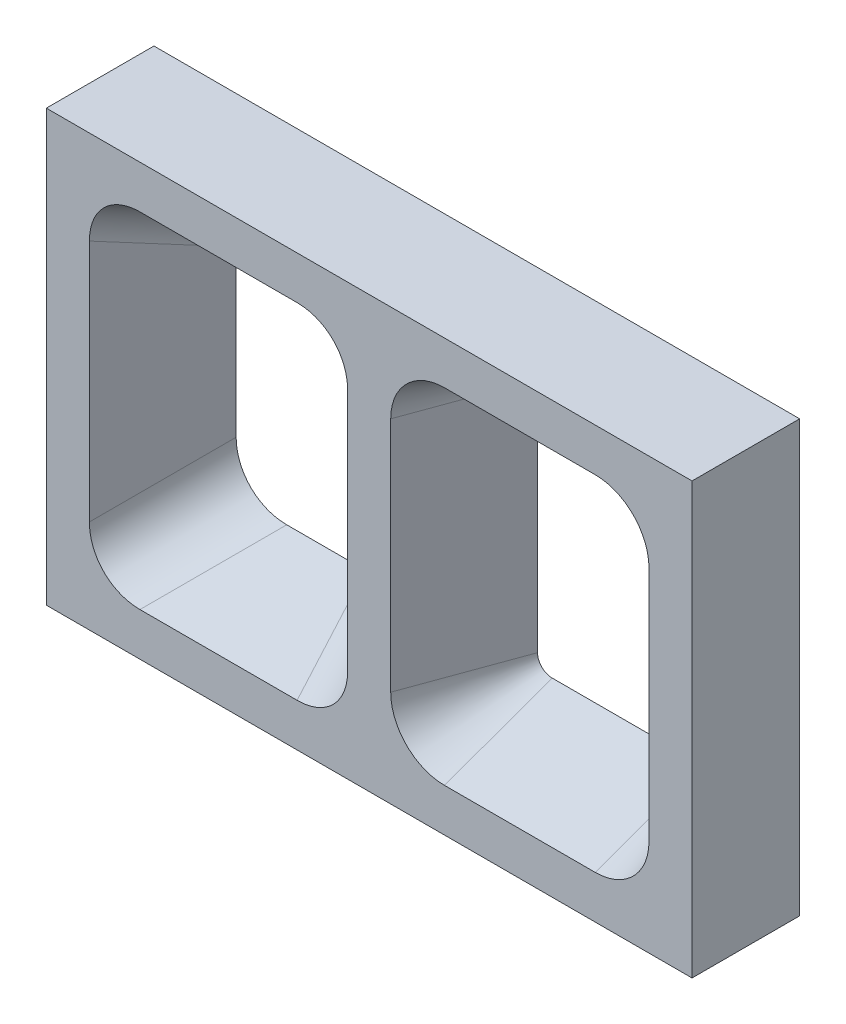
ISO-10303-21;
HEADER;
FILE_DESCRIPTION(('STEP AP214'),'2;1');
FILE_NAME('part.step','',(''),(''),'','','');
FILE_SCHEMA(('AUTOMOTIVE_DESIGN { 1 0 10303 214 1 1 1 1 }'));
ENDSEC;
DATA;
#1=APPLICATION_CONTEXT('core data for automotive mechanical design processes');
#2=APPLICATION_PROTOCOL_DEFINITION('international standard','automotive_design',2000,#1);
#3=PRODUCT_CONTEXT('',#1,'mechanical');
#4=PRODUCT('Part','Part','',(#3));
#5=PRODUCT_RELATED_PRODUCT_CATEGORY('part','',(#4));
#6=PRODUCT_DEFINITION_FORMATION('','',#4);
#7=PRODUCT_DEFINITION_CONTEXT('part definition',#1,'design');
#8=PRODUCT_DEFINITION('design','',#6,#7);
#9=PRODUCT_DEFINITION_SHAPE('','',#8);
#10=(LENGTH_UNIT() NAMED_UNIT(*) SI_UNIT(.MILLI.,.METRE.));
#11=(NAMED_UNIT(*) PLANE_ANGLE_UNIT() SI_UNIT($,.RADIAN.));
#12=(NAMED_UNIT(*) SI_UNIT($,.STERADIAN.) SOLID_ANGLE_UNIT());
#13=UNCERTAINTY_MEASURE_WITH_UNIT(LENGTH_MEASURE(1.E-05),#10,'distance_accuracy_value','');
#14=(GEOMETRIC_REPRESENTATION_CONTEXT(3) GLOBAL_UNCERTAINTY_ASSIGNED_CONTEXT((#13)) GLOBAL_UNIT_ASSIGNED_CONTEXT((#10,
#11,#12)) REPRESENTATION_CONTEXT('',''));
#15=CARTESIAN_POINT('',(0.,0.,0.));
#16=DIRECTION('',(0.,0.,1.));
#17=DIRECTION('',(1.,0.,0.));
#18=AXIS2_PLACEMENT_3D('',#15,#16,#17);
#19=CARTESIAN_POINT('',(0.,0.,12.7));
#20=DIRECTION('',(1.,0.,0.));
#21=DIRECTION('',(0.,0.,-1.));
#22=AXIS2_PLACEMENT_3D('',#19,#20,#21);
#23=PLANE('',#22);
#24=DIRECTION('',(0.,-1.,0.));
#25=VECTOR('',#24,1.);
#26=CARTESIAN_POINT('',(0.,0.,0.));
#27=LINE('',#26,#25);
#28=CARTESIAN_POINT('',(0.,50.8,0.));
#29=VERTEX_POINT('',#28);
#30=CARTESIAN_POINT('',(0.,0.,0.));
#31=VERTEX_POINT('',#30);
#32=EDGE_CURVE('E264',#29,#31,#27,.T.);
#33=ORIENTED_EDGE('',*,*,#32,.T.);
#34=DIRECTION('',(0.,0.,-1.));
#35=VECTOR('',#34,1.);
#36=CARTESIAN_POINT('',(0.,0.,12.7));
#37=LINE('',#36,#35);
#38=CARTESIAN_POINT('',(0.,0.,12.7));
#39=VERTEX_POINT('',#38);
#40=EDGE_CURVE('E296',#39,#31,#37,.T.);
#41=ORIENTED_EDGE('',*,*,#40,.F.);
#42=DIRECTION('',(0.,-1.,0.));
#43=VECTOR('',#42,1.);
#44=CARTESIAN_POINT('',(0.,0.,12.7));
#45=LINE('',#44,#43);
#46=CARTESIAN_POINT('',(0.,50.8,12.7));
#47=VERTEX_POINT('',#46);
#48=EDGE_CURVE('E278',#47,#39,#45,.T.);
#49=ORIENTED_EDGE('',*,*,#48,.F.);
#50=DIRECTION('',(0.,0.,-1.));
#51=VECTOR('',#50,1.);
#52=CARTESIAN_POINT('',(0.,50.8,12.7));
#53=LINE('',#52,#51);
#54=EDGE_CURVE('E287',#47,#29,#53,.T.);
#55=ORIENTED_EDGE('',*,*,#54,.T.);
#56=EDGE_LOOP('',(#33,#41,#49,#55));
#57=FACE_BOUND('',#56,.T.);
#58=ADVANCED_FACE('F35',(#57),#23,.F.);
#59=CARTESIAN_POINT('',(0.,0.,12.7));
#60=DIRECTION('',(0.,1.,0.));
#61=DIRECTION('',(0.,0.,1.));
#62=AXIS2_PLACEMENT_3D('',#59,#60,#61);
#63=PLANE('',#62);
#64=DIRECTION('',(1.,0.,0.));
#65=VECTOR('',#64,1.);
#66=CARTESIAN_POINT('',(0.,0.,0.));
#67=LINE('',#66,#65);
#68=CARTESIAN_POINT('',(76.2,0.,0.));
#69=VERTEX_POINT('',#68);
#70=EDGE_CURVE('E272',#31,#69,#67,.T.);
#71=ORIENTED_EDGE('',*,*,#70,.T.);
#72=DIRECTION('',(0.,0.,-1.));
#73=VECTOR('',#72,1.);
#74=CARTESIAN_POINT('',(76.2,0.,12.7));
#75=LINE('',#74,#73);
#76=CARTESIAN_POINT('',(76.2,0.,12.7));
#77=VERTEX_POINT('',#76);
#78=EDGE_CURVE('E293',#77,#69,#75,.T.);
#79=ORIENTED_EDGE('',*,*,#78,.F.);
#80=DIRECTION('',(1.,0.,0.));
#81=VECTOR('',#80,1.);
#82=CARTESIAN_POINT('',(0.,0.,12.7));
#83=LINE('',#82,#81);
#84=EDGE_CURVE('E281',#39,#77,#83,.T.);
#85=ORIENTED_EDGE('',*,*,#84,.F.);
#86=ORIENTED_EDGE('',*,*,#40,.T.);
#87=EDGE_LOOP('',(#71,#79,#85,#86));
#88=FACE_BOUND('',#87,.T.);
#89=ADVANCED_FACE('F372',(#88),#63,.F.);
#90=CARTESIAN_POINT('',(76.2,0.,12.7));
#91=DIRECTION('',(-1.,0.,0.));
#92=DIRECTION('',(0.,0.,1.));
#93=AXIS2_PLACEMENT_3D('',#90,#91,#92);
#94=PLANE('',#93);
#95=DIRECTION('',(0.,1.,0.));
#96=VECTOR('',#95,1.);
#97=CARTESIAN_POINT('',(76.2,0.,0.));
#98=LINE('',#97,#96);
#99=CARTESIAN_POINT('',(76.2,50.8,0.));
#100=VERTEX_POINT('',#99);
#101=EDGE_CURVE('E274',#69,#100,#98,.T.);
#102=ORIENTED_EDGE('',*,*,#101,.T.);
#103=DIRECTION('',(0.,0.,-1.));
#104=VECTOR('',#103,1.);
#105=CARTESIAN_POINT('',(76.2,50.8,12.7));
#106=LINE('',#105,#104);
#107=CARTESIAN_POINT('',(76.2,50.8,12.7));
#108=VERTEX_POINT('',#107);
#109=EDGE_CURVE('E290',#108,#100,#106,.T.);
#110=ORIENTED_EDGE('',*,*,#109,.F.);
#111=DIRECTION('',(0.,1.,0.));
#112=VECTOR('',#111,1.);
#113=CARTESIAN_POINT('',(76.2,0.,12.7));
#114=LINE('',#113,#112);
#115=EDGE_CURVE('E283',#77,#108,#114,.T.);
#116=ORIENTED_EDGE('',*,*,#115,.F.);
#117=ORIENTED_EDGE('',*,*,#78,.T.);
#118=EDGE_LOOP('',(#102,#110,#116,#117));
#119=FACE_BOUND('',#118,.T.);
#120=ADVANCED_FACE('F377',(#119),#94,.F.);
#121=CARTESIAN_POINT('',(0.,50.8,12.7));
#122=DIRECTION('',(0.,-1.,0.));
#123=DIRECTION('',(0.,0.,-1.));
#124=AXIS2_PLACEMENT_3D('',#121,#122,#123);
#125=PLANE('',#124);
#126=DIRECTION('',(-1.,0.,0.));
#127=VECTOR('',#126,1.);
#128=CARTESIAN_POINT('',(0.,50.8,0.));
#129=LINE('',#128,#127);
#130=EDGE_CURVE('E276',#100,#29,#129,.T.);
#131=ORIENTED_EDGE('',*,*,#130,.T.);
#132=ORIENTED_EDGE('',*,*,#54,.F.);
#133=DIRECTION('',(-1.,0.,0.));
#134=VECTOR('',#133,1.);
#135=CARTESIAN_POINT('',(0.,50.8,12.7));
#136=LINE('',#135,#134);
#137=EDGE_CURVE('E285',#108,#47,#136,.T.);
#138=ORIENTED_EDGE('',*,*,#137,.F.);
#139=ORIENTED_EDGE('',*,*,#109,.T.);
#140=EDGE_LOOP('',(#131,#132,#138,#139));
#141=FACE_BOUND('',#140,.T.);
#142=ADVANCED_FACE('F390',(#141),#125,.F.);
#143=CARTESIAN_POINT('',(0.,50.8,12.7));
#144=DIRECTION('',(0.,0.,-1.));
#145=DIRECTION('',(-1.,0.,0.));
#146=AXIS2_PLACEMENT_3D('',#143,#144,#145);
#147=PLANE('',#146);
#148=DIRECTION('',(0.,-1.,0.));
#149=VECTOR('',#148,1.);
#150=CARTESIAN_POINT('',(40.64,39.37,12.7));
#151=LINE('',#150,#149);
#152=CARTESIAN_POINT('',(40.64,39.37,12.7));
#153=VERTEX_POINT('',#152);
#154=CARTESIAN_POINT('',(40.64,11.43,12.7));
#155=VERTEX_POINT('',#154);
#156=EDGE_CURVE('E188',#153,#155,#151,.T.);
#157=ORIENTED_EDGE('',*,*,#156,.F.);
#158=CARTESIAN_POINT('',(46.99,39.37,12.7));
#159=DIRECTION('',(0.,0.,1.));
#160=DIRECTION('',(-1.,0.,0.));
#161=AXIS2_PLACEMENT_3D('',#158,#159,#160);
#162=CIRCLE('',#161,6.35);
#163=CARTESIAN_POINT('',(46.9900000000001,45.72,12.7));
#164=VERTEX_POINT('',#163);
#165=EDGE_CURVE('E192',#164,#153,#162,.T.);
#166=ORIENTED_EDGE('',*,*,#165,.F.);
#167=DIRECTION('',(-1.,0.,0.));
#168=VECTOR('',#167,1.);
#169=CARTESIAN_POINT('',(64.77,45.72,12.7));
#170=LINE('',#169,#168);
#171=CARTESIAN_POINT('',(64.77,45.72,12.7));
#172=VERTEX_POINT('',#171);
#173=EDGE_CURVE('E212',#172,#164,#170,.T.);
#174=ORIENTED_EDGE('',*,*,#173,.F.);
#175=CARTESIAN_POINT('',(64.77,39.37,12.7));
#176=DIRECTION('',(0.,0.,1.));
#177=DIRECTION('',(1.,0.,0.));
#178=AXIS2_PLACEMENT_3D('',#175,#176,#177);
#179=CIRCLE('',#178,6.35);
#180=CARTESIAN_POINT('',(71.12,39.37,12.7));
#181=VERTEX_POINT('',#180);
#182=EDGE_CURVE('E209',#181,#172,#179,.T.);
#183=ORIENTED_EDGE('',*,*,#182,.F.);
#184=DIRECTION('',(0.,1.,0.));
#185=VECTOR('',#184,1.);
#186=CARTESIAN_POINT('',(71.12,11.43,12.7));
#187=LINE('',#186,#185);
#188=CARTESIAN_POINT('',(71.12,11.43,12.7));
#189=VERTEX_POINT('',#188);
#190=EDGE_CURVE('E206',#189,#181,#187,.T.);
#191=ORIENTED_EDGE('',*,*,#190,.F.);
#192=CARTESIAN_POINT('',(64.77,11.43,12.7));
#193=DIRECTION('',(0.,0.,1.));
#194=DIRECTION('',(1.,0.,0.));
#195=AXIS2_PLACEMENT_3D('',#192,#193,#194);
#196=CIRCLE('',#195,6.35);
#197=CARTESIAN_POINT('',(64.77,5.08,12.7));
#198=VERTEX_POINT('',#197);
#199=EDGE_CURVE('E200',#198,#189,#196,.T.);
#200=ORIENTED_EDGE('',*,*,#199,.F.);
#201=DIRECTION('',(1.,0.,0.));
#202=VECTOR('',#201,1.);
#203=CARTESIAN_POINT('',(46.9900000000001,5.08,12.7));
#204=LINE('',#203,#202);
#205=CARTESIAN_POINT('',(46.9900000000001,5.08,12.7));
#206=VERTEX_POINT('',#205);
#207=EDGE_CURVE('E198',#206,#198,#204,.T.);
#208=ORIENTED_EDGE('',*,*,#207,.F.);
#209=CARTESIAN_POINT('',(46.99,11.43,12.7));
#210=DIRECTION('',(0.,0.,1.));
#211=DIRECTION('',(1.,0.,0.));
#212=AXIS2_PLACEMENT_3D('',#209,#210,#211);
#213=CIRCLE('',#212,6.35);
#214=EDGE_CURVE('E176',#155,#206,#213,.T.);
#215=ORIENTED_EDGE('',*,*,#214,.F.);
#216=EDGE_LOOP('',(#157,#166,#174,#183,#191,#200,#208,#215));
#217=FACE_BOUND('',#216,.T.);
#218=DIRECTION('',(0.,-1.,0.));
#219=VECTOR('',#218,1.);
#220=CARTESIAN_POINT('',(5.08,45.72,12.7));
#221=LINE('',#220,#219);
#222=CARTESIAN_POINT('',(5.08,39.7529518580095,12.7));
#223=VERTEX_POINT('',#222);
#224=CARTESIAN_POINT('',(5.08,11.0470481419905,12.7));
#225=VERTEX_POINT('',#224);
#226=EDGE_CURVE('E250',#223,#225,#221,.T.);
#227=ORIENTED_EDGE('',*,*,#226,.F.);
#228=CARTESIAN_POINT('',(11.837528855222,38.962471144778,12.7));
#229=DIRECTION('',(0.,0.,-1.));
#230=DIRECTION('',(0.707106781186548,-0.707106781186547,0.));
#231=AXIS2_PLACEMENT_3D('',#228,#229,#230);
#232=ELLIPSE('',#231,7.14184097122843,6.35);
#233=CARTESIAN_POINT('',(11.0470481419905,45.72,12.7));
#234=VERTEX_POINT('',#233);
#235=EDGE_CURVE('E42',#223,#234,#232,.T.);
#236=ORIENTED_EDGE('',*,*,#235,.T.);
#237=DIRECTION('',(-1.,0.,0.));
#238=VECTOR('',#237,1.);
#239=CARTESIAN_POINT('',(35.56,45.72,12.7));
#240=LINE('',#239,#238);
#241=CARTESIAN_POINT('',(29.5929518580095,45.72,12.7));
#242=VERTEX_POINT('',#241);
#243=EDGE_CURVE('E218',#242,#234,#240,.T.);
#244=ORIENTED_EDGE('',*,*,#243,.F.);
#245=CARTESIAN_POINT('',(28.802471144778,38.962471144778,12.7));
#246=DIRECTION('',(0.,0.,-1.));
#247=DIRECTION('',(-0.707106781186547,-0.707106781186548,0.));
#248=AXIS2_PLACEMENT_3D('',#245,#246,#247);
#249=ELLIPSE('',#248,7.14184097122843,6.35);
#250=CARTESIAN_POINT('',(35.56,39.7529518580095,12.7));
#251=VERTEX_POINT('',#250);
#252=EDGE_CURVE('E326',#242,#251,#249,.T.);
#253=ORIENTED_EDGE('',*,*,#252,.T.);
#254=DIRECTION('',(0.,1.,0.));
#255=VECTOR('',#254,1.);
#256=CARTESIAN_POINT('',(35.56,45.72,12.7));
#257=LINE('',#256,#255);
#258=CARTESIAN_POINT('',(35.56,11.0470481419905,12.7));
#259=VERTEX_POINT('',#258);
#260=EDGE_CURVE('E256',#259,#251,#257,.T.);
#261=ORIENTED_EDGE('',*,*,#260,.F.);
#262=CARTESIAN_POINT('',(28.802471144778,11.837528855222,12.7));
#263=DIRECTION('',(0.,0.,-1.));
#264=DIRECTION('',(-0.707106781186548,0.707106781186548,0.));
#265=AXIS2_PLACEMENT_3D('',#262,#263,#264);
#266=ELLIPSE('',#265,7.14184097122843,6.35);
#267=CARTESIAN_POINT('',(29.5929518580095,5.08,12.7));
#268=VERTEX_POINT('',#267);
#269=EDGE_CURVE('E322',#259,#268,#266,.T.);
#270=ORIENTED_EDGE('',*,*,#269,.T.);
#271=DIRECTION('',(1.,0.,0.));
#272=VECTOR('',#271,1.);
#273=CARTESIAN_POINT('',(5.08,5.08,12.7));
#274=LINE('',#273,#272);
#275=CARTESIAN_POINT('',(11.0470481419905,5.08,12.7));
#276=VERTEX_POINT('',#275);
#277=EDGE_CURVE('E253',#276,#268,#274,.T.);
#278=ORIENTED_EDGE('',*,*,#277,.F.);
#279=CARTESIAN_POINT('',(11.837528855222,11.837528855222,12.7));
#280=DIRECTION('',(0.,0.,-1.));
#281=DIRECTION('',(0.707106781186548,0.707106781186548,0.));
#282=AXIS2_PLACEMENT_3D('',#279,#280,#281);
#283=ELLIPSE('',#282,7.14184097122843,6.35);
#284=EDGE_CURVE('E318',#276,#225,#283,.T.);
#285=ORIENTED_EDGE('',*,*,#284,.T.);
#286=EDGE_LOOP('',(#227,#236,#244,#253,#261,#270,#278,#285));
#287=FACE_BOUND('',#286,.T.);
#288=ORIENTED_EDGE('',*,*,#48,.T.);
#289=ORIENTED_EDGE('',*,*,#84,.T.);
#290=ORIENTED_EDGE('',*,*,#115,.T.);
#291=ORIENTED_EDGE('',*,*,#137,.T.);
#292=EDGE_LOOP('',(#288,#289,#290,#291));
#293=FACE_BOUND('',#292,.T.);
#294=ADVANCED_FACE('F194',(#217,#287,#293),#147,.F.);
#295=CARTESIAN_POINT('',(0.,50.8,0.));
#296=DIRECTION('',(0.,0.,-1.));
#297=DIRECTION('',(-1.,0.,0.));
#298=AXIS2_PLACEMENT_3D('',#295,#296,#297);
#299=PLANE('',#298);
#300=CARTESIAN_POINT('',(46.99,39.37,0.));
#301=DIRECTION('',(0.,0.,-1.));
#302=DIRECTION('',(-1.,0.,0.));
#303=AXIS2_PLACEMENT_3D('',#300,#301,#302);
#304=CIRCLE('',#303,1.72757802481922);
#305=CARTESIAN_POINT('',(46.9900000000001,41.0975780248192,0.));
#306=VERTEX_POINT('',#305);
#307=CARTESIAN_POINT('',(45.2624219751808,39.37,0.));
#308=VERTEX_POINT('',#307);
#309=EDGE_CURVE('E215',#306,#308,#304,.F.);
#310=ORIENTED_EDGE('',*,*,#309,.T.);
#311=DIRECTION('',(0.,-1.,0.));
#312=VECTOR('',#311,1.);
#313=CARTESIAN_POINT('',(45.2624219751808,39.37,0.));
#314=LINE('',#313,#312);
#315=CARTESIAN_POINT('',(45.2624219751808,11.43,0.));
#316=VERTEX_POINT('',#315);
#317=EDGE_CURVE('E232',#308,#316,#314,.T.);
#318=ORIENTED_EDGE('',*,*,#317,.T.);
#319=CARTESIAN_POINT('',(46.99,11.43,0.));
#320=DIRECTION('',(0.,0.,-1.));
#321=DIRECTION('',(-1.,0.,0.));
#322=AXIS2_PLACEMENT_3D('',#319,#320,#321);
#323=CIRCLE('',#322,1.72757802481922);
#324=CARTESIAN_POINT('',(46.99,9.70242197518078,0.));
#325=VERTEX_POINT('',#324);
#326=EDGE_CURVE('E179',#316,#325,#323,.F.);
#327=ORIENTED_EDGE('',*,*,#326,.T.);
#328=DIRECTION('',(1.,0.,0.));
#329=VECTOR('',#328,1.);
#330=CARTESIAN_POINT('',(46.9900000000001,9.70242197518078,0.));
#331=LINE('',#330,#329);
#332=CARTESIAN_POINT('',(64.77,9.70242197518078,0.));
#333=VERTEX_POINT('',#332);
#334=EDGE_CURVE('E244',#325,#333,#331,.T.);
#335=ORIENTED_EDGE('',*,*,#334,.T.);
#336=CARTESIAN_POINT('',(64.77,11.43,0.));
#337=DIRECTION('',(0.,0.,-1.));
#338=DIRECTION('',(-1.,0.,0.));
#339=AXIS2_PLACEMENT_3D('',#336,#337,#338);
#340=CIRCLE('',#339,1.72757802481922);
#341=CARTESIAN_POINT('',(66.4975780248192,11.43,0.));
#342=VERTEX_POINT('',#341);
#343=EDGE_CURVE('E241',#333,#342,#340,.F.);
#344=ORIENTED_EDGE('',*,*,#343,.T.);
#345=DIRECTION('',(0.,1.,0.));
#346=VECTOR('',#345,1.);
#347=CARTESIAN_POINT('',(66.4975780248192,11.43,0.));
#348=LINE('',#347,#346);
#349=CARTESIAN_POINT('',(66.4975780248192,39.37,0.));
#350=VERTEX_POINT('',#349);
#351=EDGE_CURVE('E238',#342,#350,#348,.T.);
#352=ORIENTED_EDGE('',*,*,#351,.T.);
#353=CARTESIAN_POINT('',(64.77,39.37,0.));
#354=DIRECTION('',(0.,0.,-1.));
#355=DIRECTION('',(-1.,0.,0.));
#356=AXIS2_PLACEMENT_3D('',#353,#354,#355);
#357=CIRCLE('',#356,1.72757802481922);
#358=CARTESIAN_POINT('',(64.77,41.0975780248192,0.));
#359=VERTEX_POINT('',#358);
#360=EDGE_CURVE('E235',#350,#359,#357,.F.);
#361=ORIENTED_EDGE('',*,*,#360,.T.);
#362=DIRECTION('',(-1.,0.,0.));
#363=VECTOR('',#362,1.);
#364=CARTESIAN_POINT('',(64.77,41.0975780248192,0.));
#365=LINE('',#364,#363);
#366=EDGE_CURVE('E220',#359,#306,#365,.T.);
#367=ORIENTED_EDGE('',*,*,#366,.T.);
#368=EDGE_LOOP('',(#310,#318,#327,#335,#344,#352,#361,#367));
#369=FACE_BOUND('',#368,.T.);
#370=DIRECTION('',(0.,1.,0.));
#371=VECTOR('',#370,1.);
#372=CARTESIAN_POINT('',(30.9375780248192,45.72,0.));
#373=LINE('',#372,#371);
#374=CARTESIAN_POINT('',(30.9375780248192,15.6694701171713,0.));
#375=VERTEX_POINT('',#374);
#376=CARTESIAN_POINT('',(30.9375780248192,35.1305298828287,0.));
#377=VERTEX_POINT('',#376);
#378=EDGE_CURVE('E262',#375,#377,#373,.T.);
#379=ORIENTED_EDGE('',*,*,#378,.T.);
#380=CARTESIAN_POINT('',(24.1800491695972,34.3400491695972,0.));
#381=DIRECTION('',(0.,0.,-1.));
#382=DIRECTION('',(-0.707106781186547,-0.707106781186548,0.));
#383=AXIS2_PLACEMENT_3D('',#380,#381,#382);
#384=ELLIPSE('',#383,7.14184097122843,6.35);
#385=CARTESIAN_POINT('',(24.9705298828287,41.0975780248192,0.));
#386=VERTEX_POINT('',#385);
#387=EDGE_CURVE('E56',#377,#386,#384,.F.);
#388=ORIENTED_EDGE('',*,*,#387,.T.);
#389=DIRECTION('',(-1.,0.,0.));
#390=VECTOR('',#389,1.);
#391=CARTESIAN_POINT('',(5.08,41.0975780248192,0.));
#392=LINE('',#391,#390);
#393=CARTESIAN_POINT('',(15.6694701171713,41.0975780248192,0.));
#394=VERTEX_POINT('',#393);
#395=EDGE_CURVE('E259',#386,#394,#392,.T.);
#396=ORIENTED_EDGE('',*,*,#395,.T.);
#397=CARTESIAN_POINT('',(16.4599508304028,34.3400491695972,0.));
#398=DIRECTION('',(0.,0.,-1.));
#399=DIRECTION('',(0.707106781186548,-0.707106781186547,0.));
#400=AXIS2_PLACEMENT_3D('',#397,#398,#399);
#401=ELLIPSE('',#400,7.14184097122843,6.35);
#402=CARTESIAN_POINT('',(9.70242197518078,35.1305298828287,0.));
#403=VERTEX_POINT('',#402);
#404=EDGE_CURVE('E11',#394,#403,#401,.F.);
#405=ORIENTED_EDGE('',*,*,#404,.T.);
#406=DIRECTION('',(0.,-1.,0.));
#407=VECTOR('',#406,1.);
#408=CARTESIAN_POINT('',(9.70242197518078,45.72,0.));
#409=LINE('',#408,#407);
#410=CARTESIAN_POINT('',(9.70242197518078,15.6694701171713,0.));
#411=VERTEX_POINT('',#410);
#412=EDGE_CURVE('E261',#403,#411,#409,.T.);
#413=ORIENTED_EDGE('',*,*,#412,.T.);
#414=CARTESIAN_POINT('',(16.4599508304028,16.4599508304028,0.));
#415=DIRECTION('',(0.,0.,-1.));
#416=DIRECTION('',(0.707106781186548,0.707106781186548,0.));
#417=AXIS2_PLACEMENT_3D('',#414,#415,#416);
#418=ELLIPSE('',#417,7.14184097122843,6.35);
#419=CARTESIAN_POINT('',(15.6694701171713,9.70242197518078,0.));
#420=VERTEX_POINT('',#419);
#421=EDGE_CURVE('E320',#411,#420,#418,.F.);
#422=ORIENTED_EDGE('',*,*,#421,.T.);
#423=DIRECTION('',(1.,0.,0.));
#424=VECTOR('',#423,1.);
#425=CARTESIAN_POINT('',(5.08,9.70242197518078,0.));
#426=LINE('',#425,#424);
#427=CARTESIAN_POINT('',(24.9705298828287,9.70242197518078,0.));
#428=VERTEX_POINT('',#427);
#429=EDGE_CURVE('E265',#420,#428,#426,.T.);
#430=ORIENTED_EDGE('',*,*,#429,.T.);
#431=CARTESIAN_POINT('',(24.1800491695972,16.4599508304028,0.));
#432=DIRECTION('',(0.,0.,-1.));
#433=DIRECTION('',(-0.707106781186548,0.707106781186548,0.));
#434=AXIS2_PLACEMENT_3D('',#431,#432,#433);
#435=ELLIPSE('',#434,7.14184097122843,6.35);
#436=EDGE_CURVE('E324',#428,#375,#435,.F.);
#437=ORIENTED_EDGE('',*,*,#436,.T.);
#438=EDGE_LOOP('',(#379,#388,#396,#405,#413,#422,#430,#437));
#439=FACE_BOUND('',#438,.T.);
#440=ORIENTED_EDGE('',*,*,#32,.F.);
#441=ORIENTED_EDGE('',*,*,#130,.F.);
#442=ORIENTED_EDGE('',*,*,#101,.F.);
#443=ORIENTED_EDGE('',*,*,#70,.F.);
#444=EDGE_LOOP('',(#440,#441,#442,#443));
#445=FACE_BOUND('',#444,.T.);
#446=ADVANCED_FACE('F338',(#369,#439,#445),#299,.T.);
#447=CARTESIAN_POINT('',(35.56,45.72,12.7));
#448=DIRECTION('',(0.,0.939692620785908,-0.342020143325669));
#449=DIRECTION('',(0.,0.342020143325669,0.939692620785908));
#450=AXIS2_PLACEMENT_3D('',#447,#448,#449);
#451=PLANE('',#450);
#452=ORIENTED_EDGE('',*,*,#395,.F.);
#453=DIRECTION('',(0.323615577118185,0.323615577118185,0.889126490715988));
#454=VECTOR('',#453,1.);
#455=CARTESIAN_POINT('',(30.2178631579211,46.3449112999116,14.4169296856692));
#456=LINE('',#455,#454);
#457=EDGE_CURVE('E315',#386,#242,#456,.T.);
#458=ORIENTED_EDGE('',*,*,#457,.T.);
#459=ORIENTED_EDGE('',*,*,#243,.T.);
#460=DIRECTION('',(-0.323615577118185,0.323615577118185,0.889126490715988));
#461=VECTOR('',#460,1.);
#462=CARTESIAN_POINT('',(15.0445588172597,41.7224893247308,1.71692968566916));
#463=LINE('',#462,#461);
#464=EDGE_CURVE('E49',#234,#394,#463,.F.);
#465=ORIENTED_EDGE('',*,*,#464,.T.);
#466=EDGE_LOOP('',(#452,#458,#459,#465));
#467=FACE_BOUND('',#466,.T.);
#468=ADVANCED_FACE('F333',(#467),#451,.F.);
#469=CARTESIAN_POINT('',(35.56,45.72,12.7));
#470=DIRECTION('',(0.939692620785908,0.,-0.342020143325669));
#471=DIRECTION('',(-0.342020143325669,0.,-0.939692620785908));
#472=AXIS2_PLACEMENT_3D('',#469,#470,#471);
#473=PLANE('',#472);
#474=ORIENTED_EDGE('',*,*,#378,.F.);
#475=DIRECTION('',(0.323615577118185,-0.323615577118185,0.889126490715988));
#476=VECTOR('',#475,1.);
#477=CARTESIAN_POINT('',(36.1849112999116,10.4221368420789,14.4169296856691));
#478=LINE('',#477,#476);
#479=EDGE_CURVE('E311',#375,#259,#478,.T.);
#480=ORIENTED_EDGE('',*,*,#479,.T.);
#481=ORIENTED_EDGE('',*,*,#260,.T.);
#482=DIRECTION('',(0.323615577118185,0.323615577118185,0.889126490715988));
#483=VECTOR('',#482,1.);
#484=CARTESIAN_POINT('',(31.5624893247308,35.7554411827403,1.71692968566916));
#485=LINE('',#484,#483);
#486=EDGE_CURVE('E309',#251,#377,#485,.F.);
#487=ORIENTED_EDGE('',*,*,#486,.T.);
#488=EDGE_LOOP('',(#474,#480,#481,#487));
#489=FACE_BOUND('',#488,.T.);
#490=ADVANCED_FACE('F358',(#489),#473,.F.);
#491=CARTESIAN_POINT('',(5.08,5.08,12.7));
#492=DIRECTION('',(0.,-0.939692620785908,-0.342020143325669));
#493=DIRECTION('',(0.,0.342020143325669,-0.939692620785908));
#494=AXIS2_PLACEMENT_3D('',#491,#492,#493);
#495=PLANE('',#494);
#496=ORIENTED_EDGE('',*,*,#429,.F.);
#497=DIRECTION('',(-0.323615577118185,-0.323615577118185,0.889126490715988));
#498=VECTOR('',#497,1.);
#499=CARTESIAN_POINT('',(10.4221368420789,4.4550887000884,14.4169296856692));
#500=LINE('',#499,#498);
#501=EDGE_CURVE('E301',#420,#276,#500,.T.);
#502=ORIENTED_EDGE('',*,*,#501,.T.);
#503=ORIENTED_EDGE('',*,*,#277,.T.);
#504=DIRECTION('',(0.323615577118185,-0.323615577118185,0.889126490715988));
#505=VECTOR('',#504,1.);
#506=CARTESIAN_POINT('',(25.5954411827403,9.07751067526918,1.71692968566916));
#507=LINE('',#506,#505);
#508=EDGE_CURVE('E299',#268,#428,#507,.F.);
#509=ORIENTED_EDGE('',*,*,#508,.T.);
#510=EDGE_LOOP('',(#496,#502,#503,#509));
#511=FACE_BOUND('',#510,.T.);
#512=ADVANCED_FACE('F350',(#511),#495,.F.);
#513=CARTESIAN_POINT('',(5.08,45.72,12.7));
#514=DIRECTION('',(-0.939692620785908,0.,-0.342020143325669));
#515=DIRECTION('',(-0.342020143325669,0.,0.939692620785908));
#516=AXIS2_PLACEMENT_3D('',#513,#514,#515);
#517=PLANE('',#516);
#518=ORIENTED_EDGE('',*,*,#226,.T.);
#519=DIRECTION('',(-0.323615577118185,-0.323615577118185,0.889126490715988));
#520=VECTOR('',#519,1.);
#521=CARTESIAN_POINT('',(9.07751067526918,15.0445588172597,1.71692968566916));
#522=LINE('',#521,#520);
#523=EDGE_CURVE('E307',#225,#411,#522,.F.);
#524=ORIENTED_EDGE('',*,*,#523,.T.);
#525=ORIENTED_EDGE('',*,*,#412,.F.);
#526=DIRECTION('',(-0.323615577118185,0.323615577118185,0.889126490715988));
#527=VECTOR('',#526,1.);
#528=CARTESIAN_POINT('',(4.4550887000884,40.3778631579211,14.4169296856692));
#529=LINE('',#528,#527);
#530=EDGE_CURVE('E304',#403,#223,#529,.T.);
#531=ORIENTED_EDGE('',*,*,#530,.T.);
#532=EDGE_LOOP('',(#518,#524,#525,#531));
#533=FACE_BOUND('',#532,.T.);
#534=ADVANCED_FACE('F342',(#533),#517,.F.);
#535=CARTESIAN_POINT('',(46.99,39.37,12.7));
#536=DIRECTION('',(0.,0.,1.));
#537=DIRECTION('',(-1.,0.,0.));
#538=AXIS2_PLACEMENT_3D('',#535,#536,#537);
#539=CONICAL_SURFACE('',#538,6.35,0.349065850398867);
#540=ORIENTED_EDGE('',*,*,#165,.T.);
#541=DIRECTION('',(-0.342020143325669,0.,0.939692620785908));
#542=VECTOR('',#541,1.);
#543=CARTESIAN_POINT('',(40.64,39.37,12.7));
#544=LINE('',#543,#542);
#545=EDGE_CURVE('E184',#308,#153,#544,.T.);
#546=ORIENTED_EDGE('',*,*,#545,.F.);
#547=ORIENTED_EDGE('',*,*,#309,.F.);
#548=DIRECTION('',(0.,0.342020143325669,0.939692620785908));
#549=VECTOR('',#548,1.);
#550=CARTESIAN_POINT('',(46.9900000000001,45.72,12.7));
#551=LINE('',#550,#549);
#552=EDGE_CURVE('E216',#306,#164,#551,.T.);
#553=ORIENTED_EDGE('',*,*,#552,.T.);
#554=EDGE_LOOP('',(#540,#546,#547,#553));
#555=FACE_BOUND('',#554,.T.);
#556=ADVANCED_FACE('F410',(#555),#539,.F.);
#557=CARTESIAN_POINT('',(64.77,45.72,12.7));
#558=DIRECTION('',(0.,0.939692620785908,-0.342020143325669));
#559=DIRECTION('',(0.,0.342020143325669,0.939692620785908));
#560=AXIS2_PLACEMENT_3D('',#557,#558,#559);
#561=PLANE('',#560);
#562=ORIENTED_EDGE('',*,*,#173,.T.);
#563=ORIENTED_EDGE('',*,*,#552,.F.);
#564=ORIENTED_EDGE('',*,*,#366,.F.);
#565=DIRECTION('',(0.,0.342020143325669,0.939692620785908));
#566=VECTOR('',#565,1.);
#567=CARTESIAN_POINT('',(64.77,45.72,12.7));
#568=LINE('',#567,#566);
#569=EDGE_CURVE('E219',#359,#172,#568,.T.);
#570=ORIENTED_EDGE('',*,*,#569,.T.);
#571=EDGE_LOOP('',(#562,#563,#564,#570));
#572=FACE_BOUND('',#571,.T.);
#573=ADVANCED_FACE('F413',(#572),#561,.F.);
#574=CARTESIAN_POINT('',(64.77,39.37,12.7));
#575=DIRECTION('',(0.,0.,1.));
#576=DIRECTION('',(1.,0.,0.));
#577=AXIS2_PLACEMENT_3D('',#574,#575,#576);
#578=CONICAL_SURFACE('',#577,6.35,0.349065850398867);
#579=ORIENTED_EDGE('',*,*,#182,.T.);
#580=ORIENTED_EDGE('',*,*,#569,.F.);
#581=ORIENTED_EDGE('',*,*,#360,.F.);
#582=DIRECTION('',(0.342020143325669,0.,0.939692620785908));
#583=VECTOR('',#582,1.);
#584=CARTESIAN_POINT('',(71.12,39.37,12.7));
#585=LINE('',#584,#583);
#586=EDGE_CURVE('E227',#350,#181,#585,.T.);
#587=ORIENTED_EDGE('',*,*,#586,.T.);
#588=EDGE_LOOP('',(#579,#580,#581,#587));
#589=FACE_BOUND('',#588,.T.);
#590=ADVANCED_FACE('F416',(#589),#578,.F.);
#591=CARTESIAN_POINT('',(71.12,11.43,12.7));
#592=DIRECTION('',(0.939692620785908,0.,-0.342020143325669));
#593=DIRECTION('',(-0.342020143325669,0.,-0.939692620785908));
#594=AXIS2_PLACEMENT_3D('',#591,#592,#593);
#595=PLANE('',#594);
#596=ORIENTED_EDGE('',*,*,#190,.T.);
#597=ORIENTED_EDGE('',*,*,#586,.F.);
#598=ORIENTED_EDGE('',*,*,#351,.F.);
#599=DIRECTION('',(0.342020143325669,0.,0.939692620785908));
#600=VECTOR('',#599,1.);
#601=CARTESIAN_POINT('',(71.12,11.43,12.7));
#602=LINE('',#601,#600);
#603=EDGE_CURVE('E225',#342,#189,#602,.T.);
#604=ORIENTED_EDGE('',*,*,#603,.T.);
#605=EDGE_LOOP('',(#596,#597,#598,#604));
#606=FACE_BOUND('',#605,.T.);
#607=ADVANCED_FACE('F420',(#606),#595,.F.);
#608=CARTESIAN_POINT('',(64.77,11.43,12.7));
#609=DIRECTION('',(0.,0.,1.));
#610=DIRECTION('',(1.,0.,0.));
#611=AXIS2_PLACEMENT_3D('',#608,#609,#610);
#612=CONICAL_SURFACE('',#611,6.35,0.349065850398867);
#613=ORIENTED_EDGE('',*,*,#199,.T.);
#614=ORIENTED_EDGE('',*,*,#603,.F.);
#615=ORIENTED_EDGE('',*,*,#343,.F.);
#616=DIRECTION('',(0.,-0.342020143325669,0.939692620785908));
#617=VECTOR('',#616,1.);
#618=CARTESIAN_POINT('',(64.77,5.08,12.7));
#619=LINE('',#618,#617);
#620=EDGE_CURVE('E223',#333,#198,#619,.T.);
#621=ORIENTED_EDGE('',*,*,#620,.T.);
#622=EDGE_LOOP('',(#613,#614,#615,#621));
#623=FACE_BOUND('',#622,.T.);
#624=ADVANCED_FACE('F424',(#623),#612,.F.);
#625=CARTESIAN_POINT('',(46.9900000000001,5.08,12.7));
#626=DIRECTION('',(0.,-0.939692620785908,-0.342020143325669));
#627=DIRECTION('',(0.,0.342020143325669,-0.939692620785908));
#628=AXIS2_PLACEMENT_3D('',#625,#626,#627);
#629=PLANE('',#628);
#630=ORIENTED_EDGE('',*,*,#207,.T.);
#631=ORIENTED_EDGE('',*,*,#620,.F.);
#632=ORIENTED_EDGE('',*,*,#334,.F.);
#633=DIRECTION('',(0.,-0.342020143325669,0.939692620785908));
#634=VECTOR('',#633,1.);
#635=CARTESIAN_POINT('',(46.9900000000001,5.08,12.7));
#636=LINE('',#635,#634);
#637=EDGE_CURVE('E183',#325,#206,#636,.T.);
#638=ORIENTED_EDGE('',*,*,#637,.T.);
#639=EDGE_LOOP('',(#630,#631,#632,#638));
#640=FACE_BOUND('',#639,.T.);
#641=ADVANCED_FACE('F428',(#640),#629,.F.);
#642=CARTESIAN_POINT('',(46.99,11.43,12.7));
#643=DIRECTION('',(0.,0.,1.));
#644=DIRECTION('',(1.,0.,0.));
#645=AXIS2_PLACEMENT_3D('',#642,#643,#644);
#646=CONICAL_SURFACE('',#645,6.35,0.349065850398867);
#647=ORIENTED_EDGE('',*,*,#214,.T.);
#648=ORIENTED_EDGE('',*,*,#637,.F.);
#649=ORIENTED_EDGE('',*,*,#326,.F.);
#650=DIRECTION('',(-0.342020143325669,0.,0.939692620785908));
#651=VECTOR('',#650,1.);
#652=CARTESIAN_POINT('',(40.64,11.43,12.7));
#653=LINE('',#652,#651);
#654=EDGE_CURVE('E172',#316,#155,#653,.T.);
#655=ORIENTED_EDGE('',*,*,#654,.T.);
#656=EDGE_LOOP('',(#647,#648,#649,#655));
#657=FACE_BOUND('',#656,.T.);
#658=ADVANCED_FACE('F174',(#657),#646,.F.);
#659=CARTESIAN_POINT('',(40.64,39.37,12.7));
#660=DIRECTION('',(-0.939692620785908,0.,-0.342020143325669));
#661=DIRECTION('',(-0.342020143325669,0.,0.939692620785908));
#662=AXIS2_PLACEMENT_3D('',#659,#660,#661);
#663=PLANE('',#662);
#664=ORIENTED_EDGE('',*,*,#156,.T.);
#665=ORIENTED_EDGE('',*,*,#654,.F.);
#666=ORIENTED_EDGE('',*,*,#317,.F.);
#667=ORIENTED_EDGE('',*,*,#545,.T.);
#668=EDGE_LOOP('',(#664,#665,#666,#667));
#669=FACE_BOUND('',#668,.T.);
#670=ADVANCED_FACE('F189',(#669),#663,.F.);
#671=CARTESIAN_POINT('',(10.4221368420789,10.4221368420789,16.5887575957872));
#672=DIRECTION('',(0.323615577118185,0.323615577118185,-0.889126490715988));
#673=DIRECTION('',(-0.939692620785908,0.,-0.342020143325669));
#674=AXIS2_PLACEMENT_3D('',#671,#672,#673);
#675=CYLINDRICAL_SURFACE('',#674,6.35);
#676=ORIENTED_EDGE('',*,*,#421,.F.);
#677=ORIENTED_EDGE('',*,*,#523,.F.);
#678=ORIENTED_EDGE('',*,*,#284,.F.);
#679=ORIENTED_EDGE('',*,*,#501,.F.);
#680=EDGE_LOOP('',(#676,#677,#678,#679));
#681=FACE_BOUND('',#680,.T.);
#682=ADVANCED_FACE('F345',(#681),#675,.F.);
#683=CARTESIAN_POINT('',(25.9617561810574,14.6782438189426,4.89519978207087));
#684=DIRECTION('',(-0.323615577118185,0.323615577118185,-0.889126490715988));
#685=DIRECTION('',(-0.939692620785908,0.,0.342020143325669));
#686=AXIS2_PLACEMENT_3D('',#683,#684,#685);
#687=CYLINDRICAL_SURFACE('',#686,6.35);
#688=ORIENTED_EDGE('',*,*,#436,.F.);
#689=ORIENTED_EDGE('',*,*,#508,.F.);
#690=ORIENTED_EDGE('',*,*,#269,.F.);
#691=ORIENTED_EDGE('',*,*,#479,.F.);
#692=EDGE_LOOP('',(#688,#689,#690,#691));
#693=FACE_BOUND('',#692,.T.);
#694=ADVANCED_FACE('F354',(#693),#687,.F.);
#695=CARTESIAN_POINT('',(30.2178631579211,40.3778631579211,16.5887575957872));
#696=DIRECTION('',(-0.323615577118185,-0.323615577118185,-0.889126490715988));
#697=DIRECTION('',(0.,0.939692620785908,-0.342020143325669));
#698=AXIS2_PLACEMENT_3D('',#695,#696,#697);
#699=CYLINDRICAL_SURFACE('',#698,6.35);
#700=ORIENTED_EDGE('',*,*,#387,.F.);
#701=ORIENTED_EDGE('',*,*,#486,.F.);
#702=ORIENTED_EDGE('',*,*,#252,.F.);
#703=ORIENTED_EDGE('',*,*,#457,.F.);
#704=EDGE_LOOP('',(#700,#701,#702,#703));
#705=FACE_BOUND('',#704,.T.);
#706=ADVANCED_FACE('F362',(#705),#699,.F.);
#707=CARTESIAN_POINT('',(10.4221368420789,40.3778631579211,16.5887575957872));
#708=DIRECTION('',(0.323615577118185,-0.323615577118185,-0.889126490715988));
#709=DIRECTION('',(-0.939692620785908,0.,-0.342020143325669));
#710=AXIS2_PLACEMENT_3D('',#707,#708,#709);
#711=CYLINDRICAL_SURFACE('',#710,6.35);
#712=ORIENTED_EDGE('',*,*,#404,.F.);
#713=ORIENTED_EDGE('',*,*,#464,.F.);
#714=ORIENTED_EDGE('',*,*,#235,.F.);
#715=ORIENTED_EDGE('',*,*,#530,.F.);
#716=EDGE_LOOP('',(#712,#713,#714,#715));
#717=FACE_BOUND('',#716,.T.);
#718=ADVANCED_FACE('F336',(#717),#711,.F.);
#719=CLOSED_SHELL('',(#58,#89,#120,#142,#294,#446,#468,#490,#512,#534,#556,#573,#590,#607,#624,
#641,#658,#670,#682,#694,#706,#718));
#720=MANIFOLD_SOLID_BREP('B2',#719);
#721=ADVANCED_BREP_SHAPE_REPRESENTATION('',(#18,#720),#14);
#722=SHAPE_DEFINITION_REPRESENTATION(#9,#721);
ENDSEC;
END-ISO-10303-21;
